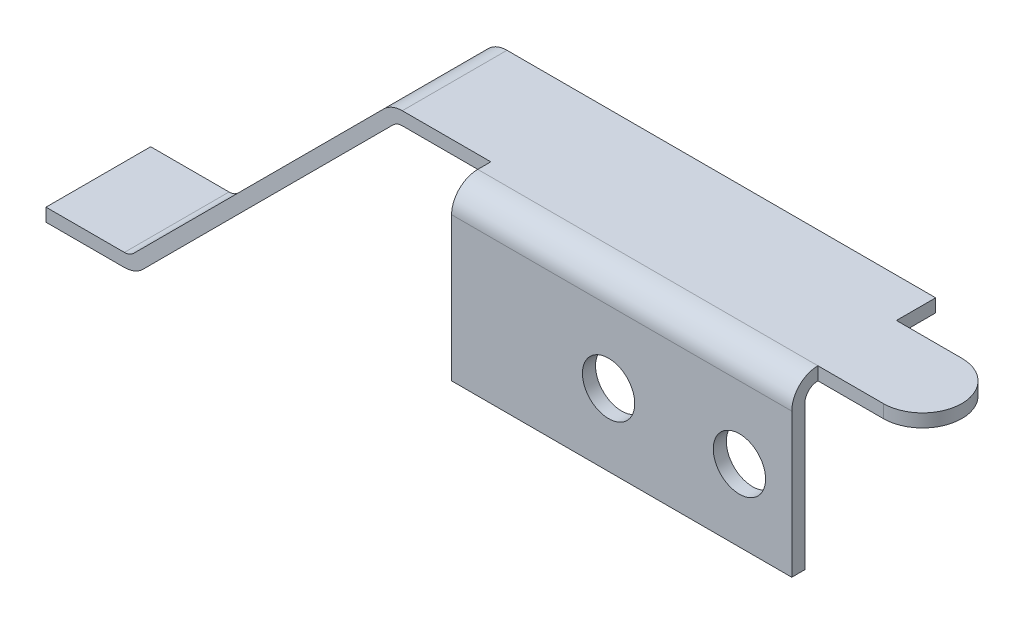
from build123d import *

# Parameters (mm, degrees)
EXTRU_MINCE1_DEPTH = 4
EXTRUSION1_DEPTH   = 0.5
EXTRU_MINCE2_DEPTH = 13
D_GAGEMENT_M21_D   = 2


with BuildPart() as part:
    # Esquisse1 → Extru.-Mince1 (new body)
    with BuildSketch(Plane.XY):
        with BuildLine():
            Line((0, 0), (2.995786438, 0))
            ThreePointArc((2.995786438, 0), (3.37846987, 0.076120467), (3.702893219, 0.292893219))
            Line((3.702893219, 0.292893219), (13.263553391, 9.853553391))
            ThreePointArc((13.263553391, 9.853553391), (13.425765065, 9.961939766), (13.617106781, 10))
            Line((13.617106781, 10), (30, 10))
            Line((30, 10), (30, 10.5))
            Line((30, 10.5), (13.617106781, 10.5))
            ThreePointArc((13.617106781, 10.5), (13.234423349, 10.423879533), (12.91, 10.207106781))
            Line((12.91, 10.207106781), (3.349339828, 0.646446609))
            ThreePointArc((3.349339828, 0.646446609), (3.187128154, 0.538060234), (2.995786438, 0.5))
            Line((2.995786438, 0.5), (0, 0.5))
            Line((0, 0.5), (0, 0))
        make_face()
    extrude(amount=EXTRU_MINCE1_DEPTH)

    # Esquisse2 → Extrusion1 (add)
    with BuildSketch(Plane(origin=(0, 10.5, 0), x_dir=(-1, 0, 0), z_dir=(0, 1, 0))):
        with BuildLine():
            Line((-32.5, 4.5), (-30, 4.5))
            Line((-30, 4.5), (-30, 1.5))
            Line((-30, 1.5), (-32.5, 1.5))
            ThreePointArc((-32.5, 1.5), (-34, 3), (-32.5, 4.5))
        make_face()
    extrude(amount=-EXTRUSION1_DEPTH)

    # Esquisse3 → Extru.-Mince2 (add)
    with BuildSketch(Plane(origin=(30, 0, 0), x_dir=(0, 0, -1), z_dir=(1, 0, 0))):
        with BuildLine():
            Line((-4, 10), (-4.5, 10))
            ThreePointArc((-4.5, 10), (-4.853553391, 9.853553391), (-5, 9.5))
            Line((-5, 9.5), (-5, 4))
            Line((-5, 4), (-5.5, 4))
            Line((-5.5, 4), (-5.5, 9.5))
            ThreePointArc((-5.5, 9.5), (-5.207106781, 10.207106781), (-4.5, 10.5))
            Line((-4.5, 10.5), (-4, 10.5))
            Line((-4, 10.5), (-4, 10))
        make_face()
    extrude(amount=-EXTRU_MINCE2_DEPTH)

    # D_gagement M21 (through all)
    with Locations(Plane.XY.offset(5.5)):
        with Locations((28, 6.75), (23, 6.75)):
            Hole(D_GAGEMENT_M21_D / 2)


solid = part.part
